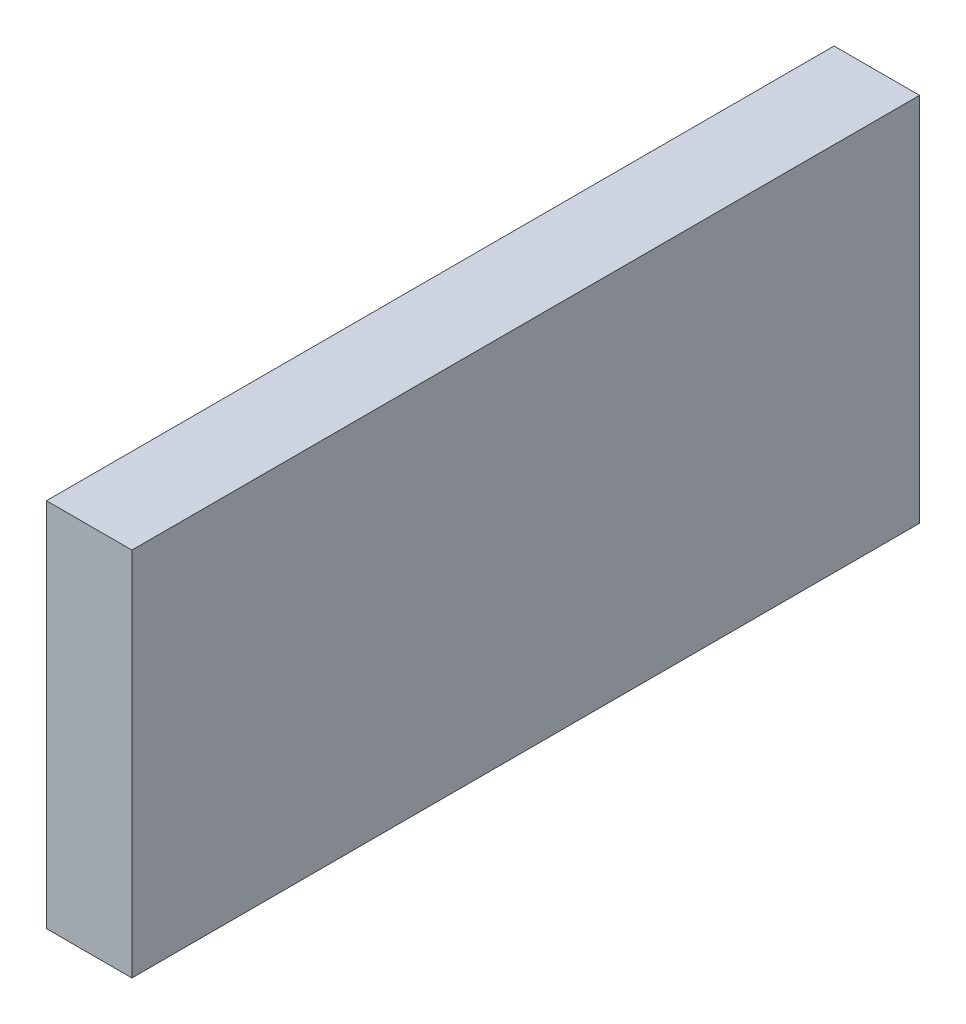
ISO-10303-21;
HEADER;
FILE_DESCRIPTION(('STEP AP214'),'2;1');
FILE_NAME('part.step','',(''),(''),'','','');
FILE_SCHEMA(('AUTOMOTIVE_DESIGN { 1 0 10303 214 1 1 1 1 }'));
ENDSEC;
DATA;
#1=APPLICATION_CONTEXT('core data for automotive mechanical design processes');
#2=APPLICATION_PROTOCOL_DEFINITION('international standard','automotive_design',2000,#1);
#3=PRODUCT_CONTEXT('',#1,'mechanical');
#4=PRODUCT('Part','Part','',(#3));
#5=PRODUCT_RELATED_PRODUCT_CATEGORY('part','',(#4));
#6=PRODUCT_DEFINITION_FORMATION('','',#4);
#7=PRODUCT_DEFINITION_CONTEXT('part definition',#1,'design');
#8=PRODUCT_DEFINITION('design','',#6,#7);
#9=PRODUCT_DEFINITION_SHAPE('','',#8);
#10=(LENGTH_UNIT() NAMED_UNIT(*) SI_UNIT(.MILLI.,.METRE.));
#11=(NAMED_UNIT(*) PLANE_ANGLE_UNIT() SI_UNIT($,.RADIAN.));
#12=(NAMED_UNIT(*) SI_UNIT($,.STERADIAN.) SOLID_ANGLE_UNIT());
#13=UNCERTAINTY_MEASURE_WITH_UNIT(LENGTH_MEASURE(1.E-05),#10,'distance_accuracy_value','');
#14=(GEOMETRIC_REPRESENTATION_CONTEXT(3) GLOBAL_UNCERTAINTY_ASSIGNED_CONTEXT((#13)) GLOBAL_UNIT_ASSIGNED_CONTEXT((#10,
#11,#12)) REPRESENTATION_CONTEXT('',''));
#15=CARTESIAN_POINT('',(0.,0.,0.));
#16=DIRECTION('',(0.,0.,1.));
#17=DIRECTION('',(1.,0.,0.));
#18=AXIS2_PLACEMENT_3D('',#15,#16,#17);
#19=CARTESIAN_POINT('',(0.,0.,-50.8));
#20=DIRECTION('',(-1.,0.,0.));
#21=DIRECTION('',(0.,-1.,0.));
#22=AXIS2_PLACEMENT_3D('',#19,#20,#21);
#23=PLANE('',#22);
#24=DIRECTION('',(0.,-1.,0.));
#25=VECTOR('',#24,1.);
#26=CARTESIAN_POINT('',(0.,0.,0.));
#27=LINE('',#26,#25);
#28=CARTESIAN_POINT('',(0.,0.,0.));
#29=VERTEX_POINT('',#28);
#30=CARTESIAN_POINT('',(0.,-23.9014,0.));
#31=VERTEX_POINT('',#30);
#32=EDGE_CURVE('E101',#29,#31,#27,.T.);
#33=ORIENTED_EDGE('',*,*,#32,.F.);
#34=DIRECTION('',(0.,0.,1.));
#35=VECTOR('',#34,1.);
#36=CARTESIAN_POINT('',(0.,0.,-50.8));
#37=LINE('',#36,#35);
#38=CARTESIAN_POINT('',(0.,0.,-50.8));
#39=VERTEX_POINT('',#38);
#40=EDGE_CURVE('E11',#39,#29,#37,.T.);
#41=ORIENTED_EDGE('',*,*,#40,.F.);
#42=DIRECTION('',(0.,-1.,0.));
#43=VECTOR('',#42,1.);
#44=CARTESIAN_POINT('',(0.,0.,-50.8));
#45=LINE('',#44,#43);
#46=CARTESIAN_POINT('',(0.,-23.9014,-50.8));
#47=VERTEX_POINT('',#46);
#48=EDGE_CURVE('E95',#39,#47,#45,.T.);
#49=ORIENTED_EDGE('',*,*,#48,.T.);
#50=DIRECTION('',(0.,0.,1.));
#51=VECTOR('',#50,1.);
#52=CARTESIAN_POINT('',(0.,-23.9014,-50.8));
#53=LINE('',#52,#51);
#54=EDGE_CURVE('E40',#47,#31,#53,.T.);
#55=ORIENTED_EDGE('',*,*,#54,.T.);
#56=EDGE_LOOP('',(#33,#41,#49,#55));
#57=FACE_BOUND('',#56,.T.);
#58=ADVANCED_FACE('F37',(#57),#23,.T.);
#59=CARTESIAN_POINT('',(0.,0.,-50.8));
#60=DIRECTION('',(0.,1.,0.));
#61=DIRECTION('',(0.,0.,1.));
#62=AXIS2_PLACEMENT_3D('',#59,#60,#61);
#63=PLANE('',#62);
#64=DIRECTION('',(-1.,0.,0.));
#65=VECTOR('',#64,1.);
#66=CARTESIAN_POINT('',(0.,0.,0.));
#67=LINE('',#66,#65);
#68=CARTESIAN_POINT('',(5.5118,0.,0.));
#69=VERTEX_POINT('',#68);
#70=EDGE_CURVE('E97',#69,#29,#67,.T.);
#71=ORIENTED_EDGE('',*,*,#70,.F.);
#72=DIRECTION('',(0.,0.,1.));
#73=VECTOR('',#72,1.);
#74=CARTESIAN_POINT('',(5.5118,0.,-50.8));
#75=LINE('',#74,#73);
#76=CARTESIAN_POINT('',(5.5118,0.,-50.8));
#77=VERTEX_POINT('',#76);
#78=EDGE_CURVE('E46',#77,#69,#75,.T.);
#79=ORIENTED_EDGE('',*,*,#78,.F.);
#80=DIRECTION('',(-1.,0.,0.));
#81=VECTOR('',#80,1.);
#82=CARTESIAN_POINT('',(0.,0.,-50.8));
#83=LINE('',#82,#81);
#84=EDGE_CURVE('E92',#77,#39,#83,.T.);
#85=ORIENTED_EDGE('',*,*,#84,.T.);
#86=ORIENTED_EDGE('',*,*,#40,.T.);
#87=EDGE_LOOP('',(#71,#79,#85,#86));
#88=FACE_BOUND('',#87,.T.);
#89=ADVANCED_FACE('F111',(#88),#63,.T.);
#90=CARTESIAN_POINT('',(5.5118,0.,-50.8));
#91=DIRECTION('',(1.,0.,0.));
#92=DIRECTION('',(0.,1.,0.));
#93=AXIS2_PLACEMENT_3D('',#90,#91,#92);
#94=PLANE('',#93);
#95=DIRECTION('',(0.,1.,0.));
#96=VECTOR('',#95,1.);
#97=CARTESIAN_POINT('',(5.5118,0.,0.));
#98=LINE('',#97,#96);
#99=CARTESIAN_POINT('',(5.5118,-23.9014,0.));
#100=VERTEX_POINT('',#99);
#101=EDGE_CURVE('E87',#100,#69,#98,.T.);
#102=ORIENTED_EDGE('',*,*,#101,.F.);
#103=DIRECTION('',(0.,0.,1.));
#104=VECTOR('',#103,1.);
#105=CARTESIAN_POINT('',(5.5118,-23.9014,-50.8));
#106=LINE('',#105,#104);
#107=CARTESIAN_POINT('',(5.5118,-23.9014,-50.8));
#108=VERTEX_POINT('',#107);
#109=EDGE_CURVE('E82',#108,#100,#106,.T.);
#110=ORIENTED_EDGE('',*,*,#109,.F.);
#111=DIRECTION('',(0.,1.,0.));
#112=VECTOR('',#111,1.);
#113=CARTESIAN_POINT('',(5.5118,0.,-50.8));
#114=LINE('',#113,#112);
#115=EDGE_CURVE('E85',#108,#77,#114,.T.);
#116=ORIENTED_EDGE('',*,*,#115,.T.);
#117=ORIENTED_EDGE('',*,*,#78,.T.);
#118=EDGE_LOOP('',(#102,#110,#116,#117));
#119=FACE_BOUND('',#118,.T.);
#120=ADVANCED_FACE('F84',(#119),#94,.T.);
#121=CARTESIAN_POINT('',(0.,-23.9014,-50.8));
#122=DIRECTION('',(0.,-1.,0.));
#123=DIRECTION('',(0.,0.,-1.));
#124=AXIS2_PLACEMENT_3D('',#121,#122,#123);
#125=PLANE('',#124);
#126=DIRECTION('',(1.,0.,0.));
#127=VECTOR('',#126,1.);
#128=CARTESIAN_POINT('',(0.,-23.9014,0.));
#129=LINE('',#128,#127);
#130=EDGE_CURVE('E104',#31,#100,#129,.T.);
#131=ORIENTED_EDGE('',*,*,#130,.F.);
#132=ORIENTED_EDGE('',*,*,#54,.F.);
#133=DIRECTION('',(1.,0.,0.));
#134=VECTOR('',#133,1.);
#135=CARTESIAN_POINT('',(0.,-23.9014,-50.8));
#136=LINE('',#135,#134);
#137=EDGE_CURVE('E91',#47,#108,#136,.T.);
#138=ORIENTED_EDGE('',*,*,#137,.T.);
#139=ORIENTED_EDGE('',*,*,#109,.T.);
#140=EDGE_LOOP('',(#131,#132,#138,#139));
#141=FACE_BOUND('',#140,.T.);
#142=ADVANCED_FACE('F94',(#141),#125,.T.);
#143=CARTESIAN_POINT('',(0.,0.,-50.8));
#144=DIRECTION('',(0.,0.,1.));
#145=DIRECTION('',(1.,0.,0.));
#146=AXIS2_PLACEMENT_3D('',#143,#144,#145);
#147=PLANE('',#146);
#148=ORIENTED_EDGE('',*,*,#48,.F.);
#149=ORIENTED_EDGE('',*,*,#84,.F.);
#150=ORIENTED_EDGE('',*,*,#115,.F.);
#151=ORIENTED_EDGE('',*,*,#137,.F.);
#152=EDGE_LOOP('',(#148,#149,#150,#151));
#153=FACE_BOUND('',#152,.T.);
#154=ADVANCED_FACE('F90',(#153),#147,.F.);
#155=CARTESIAN_POINT('',(0.,0.,0.));
#156=DIRECTION('',(0.,0.,1.));
#157=DIRECTION('',(1.,0.,0.));
#158=AXIS2_PLACEMENT_3D('',#155,#156,#157);
#159=PLANE('',#158);
#160=ORIENTED_EDGE('',*,*,#32,.T.);
#161=ORIENTED_EDGE('',*,*,#130,.T.);
#162=ORIENTED_EDGE('',*,*,#101,.T.);
#163=ORIENTED_EDGE('',*,*,#70,.T.);
#164=EDGE_LOOP('',(#160,#161,#162,#163));
#165=FACE_BOUND('',#164,.T.);
#166=ADVANCED_FACE('F110',(#165),#159,.T.);
#167=CLOSED_SHELL('',(#58,#89,#120,#142,#154,#166));
#168=MANIFOLD_SOLID_BREP('B2',#167);
#169=ADVANCED_BREP_SHAPE_REPRESENTATION('',(#18,#168),#14);
#170=SHAPE_DEFINITION_REPRESENTATION(#9,#169);
ENDSEC;
END-ISO-10303-21;
